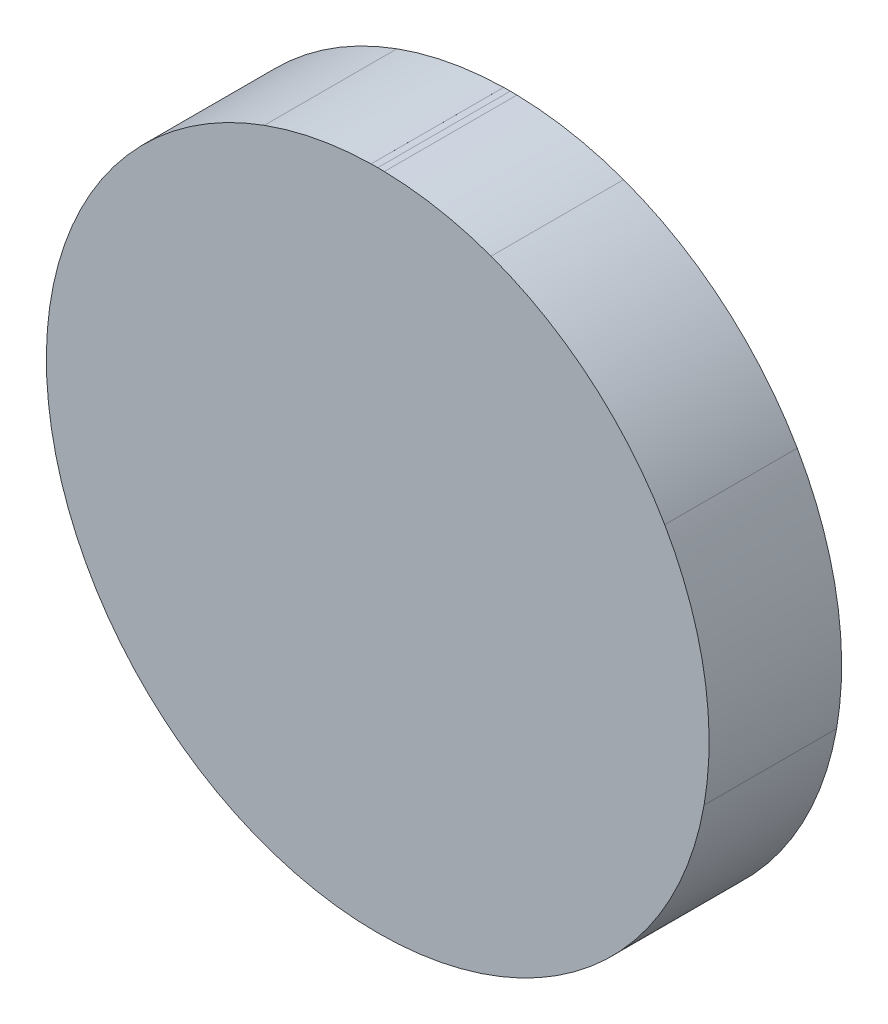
from build123d import *

# Parameters (mm, degrees)
SKIZZE1_R                       = 25
AUFSATZ_LINEAR_AUSTRAGEN1_DEPTH = 10
SCHNITT_LINEAR_AUSTRAGEN1_REACH = 38.742
SKIZZE3_R                       = 0.5
SKIZZE3_3_R                     = 0.5
SCHNITT_LINEAR_AUSTRAGEN2_DEPTH = 10
KREISMUSTER1_COUNT              = 9


with BuildPart() as part:
    # Skizze1 → Aufsatz-Linear austragen1 (new body)
    with BuildSketch(Plane.XY):
        Circle(SKIZZE1_R)
    aufsatz_linear_austragen1 = extrude(amount=AUFSATZ_LINEAR_AUSTRAGEN1_DEPTH)

    # Skizze3 → Schnitt-Linear austragen1 (cut, up to next)
    with BuildSketch(Plane.XY.offset(10), mode=Mode.PRIVATE) as schnitt_linear_austragen1_sk1:
        with Locations((0, 25)):
            Circle(SKIZZE3_R)
    schnitt_linear_austragen1_tool1 = extrude(schnitt_linear_austragen1_sk1.sketch, amount=-SCHNITT_LINEAR_AUSTRAGEN1_REACH, mode=Mode.PRIVATE) & part.part
    add(schnitt_linear_austragen1_tool1.solids().sort_by_distance((0, 25, 10))[0], mode=Mode.SUBTRACT)

    # Skizze3_3 → Schnitt-Linear austragen2 (cut)
    with BuildSketch(Plane.XY.offset(10)):
        with Locations((0, 25)):
            Circle(SKIZZE3_3_R)
        with Locations((0, -20)):
            Circle(SKIZZE3_3_R)
        with Locations((0, 15)):
            Circle(SKIZZE3_3_R)
    extrude(amount=-SCHNITT_LINEAR_AUSTRAGEN2_DEPTH, mode=Mode.SUBTRACT)

    # Kreismuster1: Aufsatz-Linear austragen1 ×9 about axis
    kreismuster1_axis = Axis((0, -0.002939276, 0), (0, 0, 1))
    for i in range(1, KREISMUSTER1_COUNT):
        add(aufsatz_linear_austragen1.rotate(kreismuster1_axis, i * 360 / KREISMUSTER1_COUNT))


solid = part.part
